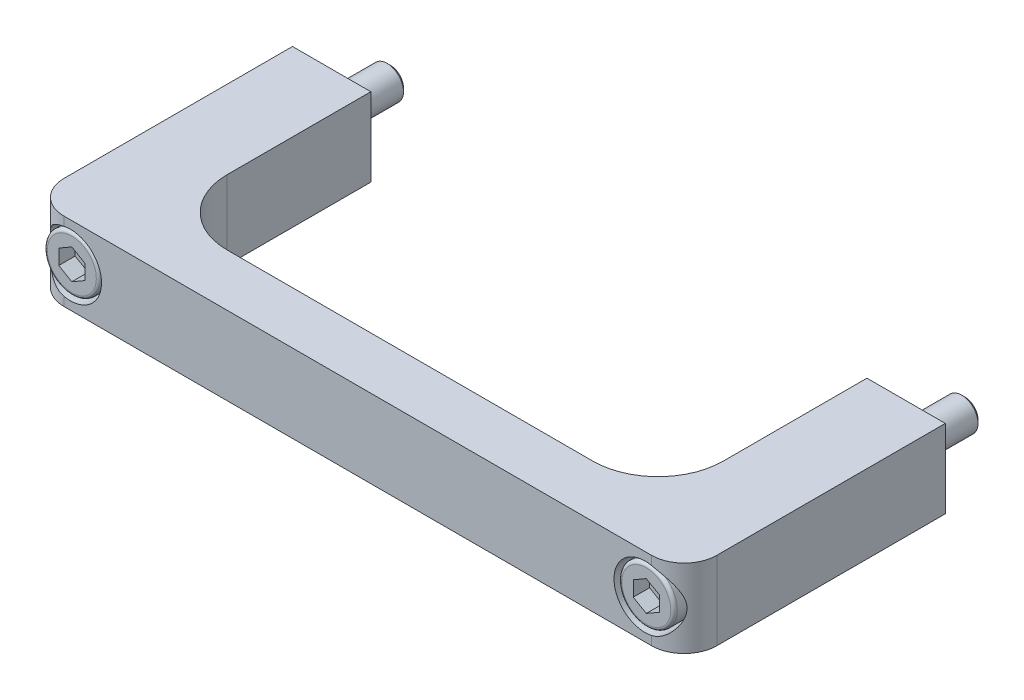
ISO-10303-21;
HEADER;
FILE_DESCRIPTION(('STEP AP214'),'2;1');
FILE_NAME('part.step','',(''),(''),'','','');
FILE_SCHEMA(('AUTOMOTIVE_DESIGN { 1 0 10303 214 1 1 1 1 }'));
ENDSEC;
DATA;
#1=APPLICATION_CONTEXT('core data for automotive mechanical design processes');
#2=APPLICATION_PROTOCOL_DEFINITION('international standard','automotive_design',2000,#1);
#3=PRODUCT_CONTEXT('',#1,'mechanical');
#4=PRODUCT('Part','Part','',(#3));
#5=PRODUCT_RELATED_PRODUCT_CATEGORY('part','',(#4));
#6=PRODUCT_DEFINITION_FORMATION('','',#4);
#7=PRODUCT_DEFINITION_CONTEXT('part definition',#1,'design');
#8=PRODUCT_DEFINITION('design','',#6,#7);
#9=PRODUCT_DEFINITION_SHAPE('','',#8);
#10=(LENGTH_UNIT() NAMED_UNIT(*) SI_UNIT(.MILLI.,.METRE.));
#11=(NAMED_UNIT(*) PLANE_ANGLE_UNIT() SI_UNIT($,.RADIAN.));
#12=(NAMED_UNIT(*) SI_UNIT($,.STERADIAN.) SOLID_ANGLE_UNIT());
#13=UNCERTAINTY_MEASURE_WITH_UNIT(LENGTH_MEASURE(1.E-05),#10,'distance_accuracy_value','');
#14=(GEOMETRIC_REPRESENTATION_CONTEXT(3) GLOBAL_UNCERTAINTY_ASSIGNED_CONTEXT((#13)) GLOBAL_UNIT_ASSIGNED_CONTEXT((#10,
#11,#12)) REPRESENTATION_CONTEXT('',''));
#15=CARTESIAN_POINT('',(0.,0.,0.));
#16=DIRECTION('',(0.,0.,1.));
#17=DIRECTION('',(1.,0.,0.));
#18=AXIS2_PLACEMENT_3D('',#15,#16,#17);
#19=CARTESIAN_POINT('',(0.,-1.30232253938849E-13,37.3));
#20=DIRECTION('',(0.,0.,1.));
#21=DIRECTION('',(0.,-1.,0.));
#22=AXIS2_PLACEMENT_3D('',#19,#20,#21);
#23=PLANE('',#22);
#24=DIRECTION('',(0.,-1.,0.));
#25=VECTOR('',#24,1.);
#26=CARTESIAN_POINT('',(86.,1.15470053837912,37.3));
#27=LINE('',#26,#25);
#28=CARTESIAN_POINT('',(86.,1.15470053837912,37.3));
#29=VERTEX_POINT('',#28);
#30=CARTESIAN_POINT('',(86.,-1.15470053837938,37.3));
#31=VERTEX_POINT('',#30);
#32=EDGE_CURVE('E192',#29,#31,#27,.T.);
#33=ORIENTED_EDGE('',*,*,#32,.T.);
#34=DIRECTION('',(0.866025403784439,-0.5,0.));
#35=VECTOR('',#34,1.);
#36=CARTESIAN_POINT('',(86.,-1.15470053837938,37.3));
#37=LINE('',#36,#35);
#38=CARTESIAN_POINT('',(88.,-2.30940107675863,37.3));
#39=VERTEX_POINT('',#38);
#40=EDGE_CURVE('E200',#31,#39,#37,.T.);
#41=ORIENTED_EDGE('',*,*,#40,.T.);
#42=DIRECTION('',(0.866025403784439,0.5,0.));
#43=VECTOR('',#42,1.);
#44=CARTESIAN_POINT('',(88.,-2.30940107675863,37.3));
#45=LINE('',#44,#43);
#46=CARTESIAN_POINT('',(90.,-1.15470053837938,37.3));
#47=VERTEX_POINT('',#46);
#48=EDGE_CURVE('E206',#39,#47,#45,.T.);
#49=ORIENTED_EDGE('',*,*,#48,.T.);
#50=DIRECTION('',(0.,1.,0.));
#51=VECTOR('',#50,1.);
#52=CARTESIAN_POINT('',(90.,-1.15470053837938,37.3));
#53=LINE('',#52,#51);
#54=CARTESIAN_POINT('',(90.,1.15470053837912,37.3));
#55=VERTEX_POINT('',#54);
#56=EDGE_CURVE('E219',#47,#55,#53,.T.);
#57=ORIENTED_EDGE('',*,*,#56,.T.);
#58=DIRECTION('',(-0.866025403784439,0.5,0.));
#59=VECTOR('',#58,1.);
#60=CARTESIAN_POINT('',(90.,1.15470053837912,37.3));
#61=LINE('',#60,#59);
#62=CARTESIAN_POINT('',(88.,2.30940107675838,37.3));
#63=VERTEX_POINT('',#62);
#64=EDGE_CURVE('E222',#55,#63,#61,.T.);
#65=ORIENTED_EDGE('',*,*,#64,.T.);
#66=DIRECTION('',(-0.866025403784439,-0.5,0.));
#67=VECTOR('',#66,1.);
#68=CARTESIAN_POINT('',(88.,2.30940107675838,37.3));
#69=LINE('',#68,#67);
#70=EDGE_CURVE('E210',#63,#29,#69,.T.);
#71=ORIENTED_EDGE('',*,*,#70,.T.);
#72=EDGE_LOOP('',(#33,#41,#49,#57,#65,#71));
#73=FACE_BOUND('',#72,.T.);
#74=ADVANCED_FACE('F14',(#73),#23,.T.);
#75=CARTESIAN_POINT('',(0.,-1.30232253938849E-13,37.3));
#76=DIRECTION('',(0.,0.,1.));
#77=DIRECTION('',(0.,-1.,0.));
#78=AXIS2_PLACEMENT_3D('',#75,#76,#77);
#79=PLANE('',#78);
#80=DIRECTION('',(0.,-1.,0.));
#81=VECTOR('',#80,1.);
#82=CARTESIAN_POINT('',(-2.,1.15470053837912,37.3));
#83=LINE('',#82,#81);
#84=CARTESIAN_POINT('',(-2.,1.15470053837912,37.3));
#85=VERTEX_POINT('',#84);
#86=CARTESIAN_POINT('',(-2.,-1.15470053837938,37.3));
#87=VERTEX_POINT('',#86);
#88=EDGE_CURVE('E196',#85,#87,#83,.T.);
#89=ORIENTED_EDGE('',*,*,#88,.T.);
#90=DIRECTION('',(0.866025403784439,-0.5,0.));
#91=VECTOR('',#90,1.);
#92=CARTESIAN_POINT('',(-2.,-1.15470053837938,37.3));
#93=LINE('',#92,#91);
#94=CARTESIAN_POINT('',(0.,-2.30940107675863,37.3));
#95=VERTEX_POINT('',#94);
#96=EDGE_CURVE('E235',#87,#95,#93,.T.);
#97=ORIENTED_EDGE('',*,*,#96,.T.);
#98=DIRECTION('',(0.866025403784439,0.5,0.));
#99=VECTOR('',#98,1.);
#100=CARTESIAN_POINT('',(0.,-2.30940107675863,37.3));
#101=LINE('',#100,#99);
#102=CARTESIAN_POINT('',(2.,-1.15470053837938,37.3));
#103=VERTEX_POINT('',#102);
#104=EDGE_CURVE('E238',#95,#103,#101,.T.);
#105=ORIENTED_EDGE('',*,*,#104,.T.);
#106=DIRECTION('',(0.,1.,0.));
#107=VECTOR('',#106,1.);
#108=CARTESIAN_POINT('',(2.,-1.15470053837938,37.3));
#109=LINE('',#108,#107);
#110=CARTESIAN_POINT('',(2.,1.15470053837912,37.3));
#111=VERTEX_POINT('',#110);
#112=EDGE_CURVE('E241',#103,#111,#109,.T.);
#113=ORIENTED_EDGE('',*,*,#112,.T.);
#114=DIRECTION('',(-0.866025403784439,0.5,0.));
#115=VECTOR('',#114,1.);
#116=CARTESIAN_POINT('',(2.,1.15470053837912,37.3));
#117=LINE('',#116,#115);
#118=CARTESIAN_POINT('',(0.,2.30940107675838,37.3));
#119=VERTEX_POINT('',#118);
#120=EDGE_CURVE('E244',#111,#119,#117,.T.);
#121=ORIENTED_EDGE('',*,*,#120,.T.);
#122=DIRECTION('',(-0.866025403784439,-0.5,0.));
#123=VECTOR('',#122,1.);
#124=CARTESIAN_POINT('',(0.,2.30940107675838,37.3));
#125=LINE('',#124,#123);
#126=EDGE_CURVE('E247',#119,#85,#125,.T.);
#127=ORIENTED_EDGE('',*,*,#126,.T.);
#128=EDGE_LOOP('',(#89,#97,#105,#113,#121,#127));
#129=FACE_BOUND('',#128,.T.);
#130=ADVANCED_FACE('F535',(#129),#79,.T.);
#131=CARTESIAN_POINT('',(86.,-1.1547005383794,42.3));
#132=DIRECTION('',(0.5,0.866025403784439,0.));
#133=DIRECTION('',(-0.866025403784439,0.5,0.));
#134=AXIS2_PLACEMENT_3D('',#131,#132,#133);
#135=PLANE('',#134);
#136=DIRECTION('',(0.866025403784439,-0.5,0.));
#137=VECTOR('',#136,1.);
#138=CARTESIAN_POINT('',(87.,-1.73205080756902,39.8));
#139=LINE('',#138,#137);
#140=CARTESIAN_POINT('',(86.,-1.15470053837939,39.8));
#141=VERTEX_POINT('',#140);
#142=CARTESIAN_POINT('',(88.,-2.30940107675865,39.8));
#143=VERTEX_POINT('',#142);
#144=EDGE_CURVE('E23',#141,#143,#139,.T.);
#145=ORIENTED_EDGE('',*,*,#144,.T.);
#146=DIRECTION('',(0.,0.,-1.));
#147=VECTOR('',#146,1.);
#148=CARTESIAN_POINT('',(88.,-2.30940107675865,42.3));
#149=LINE('',#148,#147);
#150=EDGE_CURVE('E197',#143,#39,#149,.T.);
#151=ORIENTED_EDGE('',*,*,#150,.T.);
#152=ORIENTED_EDGE('',*,*,#40,.F.);
#153=DIRECTION('',(0.,0.,-1.));
#154=VECTOR('',#153,1.);
#155=CARTESIAN_POINT('',(86.,-1.1547005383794,42.3));
#156=LINE('',#155,#154);
#157=EDGE_CURVE('E187',#141,#31,#156,.T.);
#158=ORIENTED_EDGE('',*,*,#157,.F.);
#159=EDGE_LOOP('',(#145,#151,#152,#158));
#160=FACE_BOUND('',#159,.T.);
#161=ADVANCED_FACE('F201',(#160),#135,.T.);
#162=CARTESIAN_POINT('',(88.,-2.30940107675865,42.3));
#163=DIRECTION('',(-0.5,0.866025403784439,0.));
#164=DIRECTION('',(-0.866025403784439,-0.5,0.));
#165=AXIS2_PLACEMENT_3D('',#162,#163,#164);
#166=PLANE('',#165);
#167=DIRECTION('',(0.866025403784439,0.5,0.));
#168=VECTOR('',#167,1.);
#169=CARTESIAN_POINT('',(89.,-1.73205080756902,39.8));
#170=LINE('',#169,#168);
#171=CARTESIAN_POINT('',(90.,-1.15470053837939,39.8));
#172=VERTEX_POINT('',#171);
#173=EDGE_CURVE('E438',#143,#172,#170,.T.);
#174=ORIENTED_EDGE('',*,*,#173,.T.);
#175=DIRECTION('',(0.,0.,-1.));
#176=VECTOR('',#175,1.);
#177=CARTESIAN_POINT('',(90.,-1.1547005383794,42.3));
#178=LINE('',#177,#176);
#179=EDGE_CURVE('E230',#172,#47,#178,.T.);
#180=ORIENTED_EDGE('',*,*,#179,.T.);
#181=ORIENTED_EDGE('',*,*,#48,.F.);
#182=ORIENTED_EDGE('',*,*,#150,.F.);
#183=EDGE_LOOP('',(#174,#180,#181,#182));
#184=FACE_BOUND('',#183,.T.);
#185=ADVANCED_FACE('F443',(#184),#166,.T.);
#186=CARTESIAN_POINT('',(90.,-1.1547005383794,42.3));
#187=DIRECTION('',(-1.,0.,0.));
#188=DIRECTION('',(0.,-1.,0.));
#189=AXIS2_PLACEMENT_3D('',#186,#187,#188);
#190=PLANE('',#189);
#191=ORIENTED_EDGE('',*,*,#179,.F.);
#192=DIRECTION('',(0.,1.,0.));
#193=VECTOR('',#192,1.);
#194=CARTESIAN_POINT('',(90.,-1.38960957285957E-13,39.8));
#195=LINE('',#194,#193);
#196=CARTESIAN_POINT('',(90.,1.15470053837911,39.8));
#197=VERTEX_POINT('',#196);
#198=EDGE_CURVE('E436',#172,#197,#195,.T.);
#199=ORIENTED_EDGE('',*,*,#198,.T.);
#200=DIRECTION('',(0.,0.,-1.));
#201=VECTOR('',#200,1.);
#202=CARTESIAN_POINT('',(90.,1.1547005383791,42.3));
#203=LINE('',#202,#201);
#204=EDGE_CURVE('E228',#197,#55,#203,.T.);
#205=ORIENTED_EDGE('',*,*,#204,.T.);
#206=ORIENTED_EDGE('',*,*,#56,.F.);
#207=EDGE_LOOP('',(#191,#199,#205,#206));
#208=FACE_BOUND('',#207,.T.);
#209=ADVANCED_FACE('F450',(#208),#190,.T.);
#210=CARTESIAN_POINT('',(90.,1.1547005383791,42.3));
#211=DIRECTION('',(-0.5,-0.866025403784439,0.));
#212=DIRECTION('',(0.866025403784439,-0.5,0.));
#213=AXIS2_PLACEMENT_3D('',#210,#211,#212);
#214=PLANE('',#213);
#215=DIRECTION('',(-0.866025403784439,0.5,0.));
#216=VECTOR('',#215,1.);
#217=CARTESIAN_POINT('',(89.,1.73205080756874,39.8));
#218=LINE('',#217,#216);
#219=CARTESIAN_POINT('',(88.,2.30940107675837,39.8));
#220=VERTEX_POINT('',#219);
#221=EDGE_CURVE('E434',#197,#220,#218,.T.);
#222=ORIENTED_EDGE('',*,*,#221,.T.);
#223=DIRECTION('',(0.,0.,-1.));
#224=VECTOR('',#223,1.);
#225=CARTESIAN_POINT('',(88.,2.30940107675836,42.3));
#226=LINE('',#225,#224);
#227=EDGE_CURVE('E30',#220,#63,#226,.T.);
#228=ORIENTED_EDGE('',*,*,#227,.T.);
#229=ORIENTED_EDGE('',*,*,#64,.F.);
#230=ORIENTED_EDGE('',*,*,#204,.F.);
#231=EDGE_LOOP('',(#222,#228,#229,#230));
#232=FACE_BOUND('',#231,.T.);
#233=ADVANCED_FACE('F454',(#232),#214,.T.);
#234=CARTESIAN_POINT('',(88.,2.30940107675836,42.3));
#235=DIRECTION('',(0.5,-0.866025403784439,0.));
#236=DIRECTION('',(0.866025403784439,0.5,0.));
#237=AXIS2_PLACEMENT_3D('',#234,#235,#236);
#238=PLANE('',#237);
#239=DIRECTION('',(-0.866025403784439,-0.5,0.));
#240=VECTOR('',#239,1.);
#241=CARTESIAN_POINT('',(87.,1.73205080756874,39.8));
#242=LINE('',#241,#240);
#243=CARTESIAN_POINT('',(86.,1.15470053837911,39.8));
#244=VERTEX_POINT('',#243);
#245=EDGE_CURVE('E432',#220,#244,#242,.T.);
#246=ORIENTED_EDGE('',*,*,#245,.T.);
#247=DIRECTION('',(0.,0.,-1.));
#248=VECTOR('',#247,1.);
#249=CARTESIAN_POINT('',(86.,1.1547005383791,42.3));
#250=LINE('',#249,#248);
#251=EDGE_CURVE('E225',#244,#29,#250,.T.);
#252=ORIENTED_EDGE('',*,*,#251,.T.);
#253=ORIENTED_EDGE('',*,*,#70,.F.);
#254=ORIENTED_EDGE('',*,*,#227,.F.);
#255=EDGE_LOOP('',(#246,#252,#253,#254));
#256=FACE_BOUND('',#255,.T.);
#257=ADVANCED_FACE('F455',(#256),#238,.T.);
#258=CARTESIAN_POINT('',(86.,1.1547005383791,42.3));
#259=DIRECTION('',(1.,0.,0.));
#260=DIRECTION('',(0.,1.,0.));
#261=AXIS2_PLACEMENT_3D('',#258,#259,#260);
#262=PLANE('',#261);
#263=DIRECTION('',(0.,-1.,0.));
#264=VECTOR('',#263,1.);
#265=CARTESIAN_POINT('',(86.,-1.38960957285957E-13,39.8));
#266=LINE('',#265,#264);
#267=EDGE_CURVE('E9',#244,#141,#266,.T.);
#268=ORIENTED_EDGE('',*,*,#267,.T.);
#269=ORIENTED_EDGE('',*,*,#157,.T.);
#270=ORIENTED_EDGE('',*,*,#32,.F.);
#271=ORIENTED_EDGE('',*,*,#251,.F.);
#272=EDGE_LOOP('',(#268,#269,#270,#271));
#273=FACE_BOUND('',#272,.T.);
#274=ADVANCED_FACE('F189',(#273),#262,.T.);
#275=CARTESIAN_POINT('',(-2.,-1.1547005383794,42.3));
#276=DIRECTION('',(0.5,0.866025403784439,0.));
#277=DIRECTION('',(-0.866025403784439,0.5,0.));
#278=AXIS2_PLACEMENT_3D('',#275,#276,#277);
#279=PLANE('',#278);
#280=DIRECTION('',(0.866025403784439,-0.5,0.));
#281=VECTOR('',#280,1.);
#282=CARTESIAN_POINT('',(-1.,-1.73205080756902,39.8));
#283=LINE('',#282,#281);
#284=CARTESIAN_POINT('',(-2.,-1.15470053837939,39.8));
#285=VERTEX_POINT('',#284);
#286=CARTESIAN_POINT('',(0.,-2.30940107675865,39.8));
#287=VERTEX_POINT('',#286);
#288=EDGE_CURVE('E428',#285,#287,#283,.T.);
#289=ORIENTED_EDGE('',*,*,#288,.T.);
#290=DIRECTION('',(0.,0.,-1.));
#291=VECTOR('',#290,1.);
#292=CARTESIAN_POINT('',(0.,-2.30940107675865,42.3));
#293=LINE('',#292,#291);
#294=EDGE_CURVE('E257',#287,#95,#293,.T.);
#295=ORIENTED_EDGE('',*,*,#294,.T.);
#296=ORIENTED_EDGE('',*,*,#96,.F.);
#297=DIRECTION('',(0.,0.,-1.));
#298=VECTOR('',#297,1.);
#299=CARTESIAN_POINT('',(-2.,-1.1547005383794,42.3));
#300=LINE('',#299,#298);
#301=EDGE_CURVE('E259',#285,#87,#300,.T.);
#302=ORIENTED_EDGE('',*,*,#301,.F.);
#303=EDGE_LOOP('',(#289,#295,#296,#302));
#304=FACE_BOUND('',#303,.T.);
#305=ADVANCED_FACE('F464',(#304),#279,.T.);
#306=CARTESIAN_POINT('',(0.,-2.30940107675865,42.3));
#307=DIRECTION('',(-0.5,0.866025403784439,0.));
#308=DIRECTION('',(-0.866025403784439,-0.5,0.));
#309=AXIS2_PLACEMENT_3D('',#306,#307,#308);
#310=PLANE('',#309);
#311=DIRECTION('',(0.866025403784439,0.5,0.));
#312=VECTOR('',#311,1.);
#313=CARTESIAN_POINT('',(1.,-1.73205080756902,39.8));
#314=LINE('',#313,#312);
#315=CARTESIAN_POINT('',(2.,-1.15470053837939,39.8));
#316=VERTEX_POINT('',#315);
#317=EDGE_CURVE('E425',#287,#316,#314,.T.);
#318=ORIENTED_EDGE('',*,*,#317,.T.);
#319=DIRECTION('',(0.,0.,-1.));
#320=VECTOR('',#319,1.);
#321=CARTESIAN_POINT('',(2.,-1.1547005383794,42.3));
#322=LINE('',#321,#320);
#323=EDGE_CURVE('E255',#316,#103,#322,.T.);
#324=ORIENTED_EDGE('',*,*,#323,.T.);
#325=ORIENTED_EDGE('',*,*,#104,.F.);
#326=ORIENTED_EDGE('',*,*,#294,.F.);
#327=EDGE_LOOP('',(#318,#324,#325,#326));
#328=FACE_BOUND('',#327,.T.);
#329=ADVANCED_FACE('F553',(#328),#310,.T.);
#330=CARTESIAN_POINT('',(2.,-1.1547005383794,42.3));
#331=DIRECTION('',(-1.,0.,0.));
#332=DIRECTION('',(0.,-1.,0.));
#333=AXIS2_PLACEMENT_3D('',#330,#331,#332);
#334=PLANE('',#333);
#335=ORIENTED_EDGE('',*,*,#323,.F.);
#336=DIRECTION('',(0.,1.,0.));
#337=VECTOR('',#336,1.);
#338=CARTESIAN_POINT('',(2.,-1.38960957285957E-13,39.8));
#339=LINE('',#338,#337);
#340=CARTESIAN_POINT('',(2.,1.15470053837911,39.8));
#341=VERTEX_POINT('',#340);
#342=EDGE_CURVE('E423',#316,#341,#339,.T.);
#343=ORIENTED_EDGE('',*,*,#342,.T.);
#344=DIRECTION('',(0.,0.,-1.));
#345=VECTOR('',#344,1.);
#346=CARTESIAN_POINT('',(2.,1.1547005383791,42.3));
#347=LINE('',#346,#345);
#348=EDGE_CURVE('E253',#341,#111,#347,.T.);
#349=ORIENTED_EDGE('',*,*,#348,.T.);
#350=ORIENTED_EDGE('',*,*,#112,.F.);
#351=EDGE_LOOP('',(#335,#343,#349,#350));
#352=FACE_BOUND('',#351,.T.);
#353=ADVANCED_FACE('F546',(#352),#334,.T.);
#354=CARTESIAN_POINT('',(2.,1.1547005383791,42.3));
#355=DIRECTION('',(-0.5,-0.866025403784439,0.));
#356=DIRECTION('',(0.866025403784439,-0.5,0.));
#357=AXIS2_PLACEMENT_3D('',#354,#355,#356);
#358=PLANE('',#357);
#359=DIRECTION('',(-0.866025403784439,0.5,0.));
#360=VECTOR('',#359,1.);
#361=CARTESIAN_POINT('',(1.,1.73205080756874,39.8));
#362=LINE('',#361,#360);
#363=CARTESIAN_POINT('',(0.,2.30940107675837,39.8));
#364=VERTEX_POINT('',#363);
#365=EDGE_CURVE('E421',#341,#364,#362,.T.);
#366=ORIENTED_EDGE('',*,*,#365,.T.);
#367=DIRECTION('',(0.,0.,-1.));
#368=VECTOR('',#367,1.);
#369=CARTESIAN_POINT('',(0.,2.30940107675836,42.3));
#370=LINE('',#369,#368);
#371=EDGE_CURVE('E38',#364,#119,#370,.T.);
#372=ORIENTED_EDGE('',*,*,#371,.T.);
#373=ORIENTED_EDGE('',*,*,#120,.F.);
#374=ORIENTED_EDGE('',*,*,#348,.F.);
#375=EDGE_LOOP('',(#366,#372,#373,#374));
#376=FACE_BOUND('',#375,.T.);
#377=ADVANCED_FACE('F539',(#376),#358,.T.);
#378=CARTESIAN_POINT('',(0.,2.30940107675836,42.3));
#379=DIRECTION('',(0.5,-0.866025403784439,0.));
#380=DIRECTION('',(0.866025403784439,0.5,0.));
#381=AXIS2_PLACEMENT_3D('',#378,#379,#380);
#382=PLANE('',#381);
#383=DIRECTION('',(-0.866025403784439,-0.5,0.));
#384=VECTOR('',#383,1.);
#385=CARTESIAN_POINT('',(-1.,1.73205080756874,39.8));
#386=LINE('',#385,#384);
#387=CARTESIAN_POINT('',(-2.,1.15470053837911,39.8));
#388=VERTEX_POINT('',#387);
#389=EDGE_CURVE('E419',#364,#388,#386,.T.);
#390=ORIENTED_EDGE('',*,*,#389,.T.);
#391=DIRECTION('',(0.,0.,-1.));
#392=VECTOR('',#391,1.);
#393=CARTESIAN_POINT('',(-2.,1.1547005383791,42.3));
#394=LINE('',#393,#392);
#395=EDGE_CURVE('E250',#388,#85,#394,.T.);
#396=ORIENTED_EDGE('',*,*,#395,.T.);
#397=ORIENTED_EDGE('',*,*,#126,.F.);
#398=ORIENTED_EDGE('',*,*,#371,.F.);
#399=EDGE_LOOP('',(#390,#396,#397,#398));
#400=FACE_BOUND('',#399,.T.);
#401=ADVANCED_FACE('F537',(#400),#382,.T.);
#402=CARTESIAN_POINT('',(-2.,1.1547005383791,42.3));
#403=DIRECTION('',(1.,0.,0.));
#404=DIRECTION('',(0.,1.,0.));
#405=AXIS2_PLACEMENT_3D('',#402,#403,#404);
#406=PLANE('',#405);
#407=DIRECTION('',(0.,-1.,0.));
#408=VECTOR('',#407,1.);
#409=CARTESIAN_POINT('',(-2.,-1.38960957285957E-13,39.8));
#410=LINE('',#409,#408);
#411=EDGE_CURVE('E430',#388,#285,#410,.T.);
#412=ORIENTED_EDGE('',*,*,#411,.T.);
#413=ORIENTED_EDGE('',*,*,#301,.T.);
#414=ORIENTED_EDGE('',*,*,#88,.F.);
#415=ORIENTED_EDGE('',*,*,#395,.F.);
#416=EDGE_LOOP('',(#412,#413,#414,#415));
#417=FACE_BOUND('',#416,.T.);
#418=ADVANCED_FACE('F489',(#417),#406,.T.);
#419=CARTESIAN_POINT('',(88.,-1.38960957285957E-13,39.8));
#420=DIRECTION('',(0.,0.,-1.));
#421=DIRECTION('',(0.,1.,0.));
#422=AXIS2_PLACEMENT_3D('',#419,#420,#421);
#423=PLANE('',#422);
#424=CARTESIAN_POINT('',(88.,-1.38960957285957E-13,39.8));
#425=DIRECTION('',(0.,0.,-1.));
#426=DIRECTION('',(0.,1.,0.));
#427=AXIS2_PLACEMENT_3D('',#424,#425,#426);
#428=CIRCLE('',#427,3.75);
#429=CARTESIAN_POINT('',(88.,3.74999999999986,39.8));
#430=VERTEX_POINT('',#429);
#431=EDGE_CURVE('E267',#430,#430,#428,.T.);
#432=ORIENTED_EDGE('',*,*,#431,.F.);
#433=EDGE_LOOP('',(#432));
#434=FACE_BOUND('',#433,.T.);
#435=ORIENTED_EDGE('',*,*,#267,.F.);
#436=ORIENTED_EDGE('',*,*,#245,.F.);
#437=ORIENTED_EDGE('',*,*,#221,.F.);
#438=ORIENTED_EDGE('',*,*,#198,.F.);
#439=ORIENTED_EDGE('',*,*,#173,.F.);
#440=ORIENTED_EDGE('',*,*,#144,.F.);
#441=EDGE_LOOP('',(#435,#436,#437,#438,#439,#440));
#442=FACE_BOUND('',#441,.T.);
#443=ADVANCED_FACE('F445',(#434,#442),#423,.F.);
#444=CARTESIAN_POINT('',(0.,-1.38960957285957E-13,39.8));
#445=DIRECTION('',(0.,0.,-1.));
#446=DIRECTION('',(0.,1.,0.));
#447=AXIS2_PLACEMENT_3D('',#444,#445,#446);
#448=PLANE('',#447);
#449=CARTESIAN_POINT('',(0.,-1.38960957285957E-13,39.8));
#450=DIRECTION('',(0.,0.,-1.));
#451=DIRECTION('',(0.,1.,0.));
#452=AXIS2_PLACEMENT_3D('',#449,#450,#451);
#453=CIRCLE('',#452,3.75);
#454=CARTESIAN_POINT('',(0.,3.74999999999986,39.8));
#455=VERTEX_POINT('',#454);
#456=EDGE_CURVE('E276',#455,#455,#453,.T.);
#457=ORIENTED_EDGE('',*,*,#456,.F.);
#458=EDGE_LOOP('',(#457));
#459=FACE_BOUND('',#458,.T.);
#460=ORIENTED_EDGE('',*,*,#411,.F.);
#461=ORIENTED_EDGE('',*,*,#389,.F.);
#462=ORIENTED_EDGE('',*,*,#365,.F.);
#463=ORIENTED_EDGE('',*,*,#342,.F.);
#464=ORIENTED_EDGE('',*,*,#317,.F.);
#465=ORIENTED_EDGE('',*,*,#288,.F.);
#466=EDGE_LOOP('',(#460,#461,#462,#463,#464,#465));
#467=FACE_BOUND('',#466,.T.);
#468=ADVANCED_FACE('F500',(#459,#467),#448,.F.);
#469=CARTESIAN_POINT('',(88.,-1.37215216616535E-13,39.3));
#470=DIRECTION('',(0.,0.,-1.));
#471=DIRECTION('',(0.,1.,0.));
#472=AXIS2_PLACEMENT_3D('',#469,#470,#471);
#473=TOROIDAL_SURFACE('',#472,3.75000000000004,0.499999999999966);
#474=ORIENTED_EDGE('',*,*,#431,.T.);
#475=EDGE_LOOP('',(#474));
#476=FACE_BOUND('',#475,.T.);
#477=CARTESIAN_POINT('',(88.,-1.37215216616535E-13,39.3));
#478=DIRECTION('',(0.,0.,-1.));
#479=DIRECTION('',(0.,1.,0.));
#480=AXIS2_PLACEMENT_3D('',#477,#478,#479);
#481=CIRCLE('',#480,4.25);
#482=CARTESIAN_POINT('',(88.,4.24999999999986,39.3));
#483=VERTEX_POINT('',#482);
#484=EDGE_CURVE('E264',#483,#483,#481,.T.);
#485=ORIENTED_EDGE('',*,*,#484,.F.);
#486=EDGE_LOOP('',(#485));
#487=FACE_BOUND('',#486,.T.);
#488=ADVANCED_FACE('F497',(#476,#487),#473,.T.);
#489=CARTESIAN_POINT('',(0.,-1.37215216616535E-13,39.3));
#490=DIRECTION('',(0.,0.,-1.));
#491=DIRECTION('',(0.,1.,0.));
#492=AXIS2_PLACEMENT_3D('',#489,#490,#491);
#493=TOROIDAL_SURFACE('',#492,3.75,0.5);
#494=ORIENTED_EDGE('',*,*,#456,.T.);
#495=EDGE_LOOP('',(#494));
#496=FACE_BOUND('',#495,.T.);
#497=CARTESIAN_POINT('',(0.,-1.37215216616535E-13,39.3));
#498=DIRECTION('',(0.,0.,-1.));
#499=DIRECTION('',(0.,1.,0.));
#500=AXIS2_PLACEMENT_3D('',#497,#498,#499);
#501=CIRCLE('',#500,4.25);
#502=CARTESIAN_POINT('',(0.,4.24999999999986,39.3));
#503=VERTEX_POINT('',#502);
#504=EDGE_CURVE('E273',#503,#503,#501,.T.);
#505=ORIENTED_EDGE('',*,*,#504,.F.);
#506=EDGE_LOOP('',(#505));
#507=FACE_BOUND('',#506,.T.);
#508=ADVANCED_FACE('F495',(#496,#507),#493,.T.);
#509=CARTESIAN_POINT('',(88.,0.,-9.));
#510=DIRECTION('',(0.,0.,-1.));
#511=DIRECTION('',(0.,1.,0.));
#512=AXIS2_PLACEMENT_3D('',#509,#510,#511);
#513=CYLINDRICAL_SURFACE('',#512,4.25);
#514=CARTESIAN_POINT('',(88.,-1.21503550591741E-13,34.8));
#515=DIRECTION('',(0.,0.,-1.));
#516=DIRECTION('',(0.,1.,0.));
#517=AXIS2_PLACEMENT_3D('',#514,#515,#516);
#518=CIRCLE('',#517,4.25);
#519=CARTESIAN_POINT('',(88.,4.24999999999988,34.8));
#520=VERTEX_POINT('',#519);
#521=EDGE_CURVE('E261',#520,#520,#518,.T.);
#522=ORIENTED_EDGE('',*,*,#521,.F.);
#523=EDGE_LOOP('',(#522));
#524=FACE_BOUND('',#523,.T.);
#525=ORIENTED_EDGE('',*,*,#484,.T.);
#526=EDGE_LOOP('',(#525));
#527=FACE_BOUND('',#526,.T.);
#528=ADVANCED_FACE('F491',(#524,#527),#513,.T.);
#529=CARTESIAN_POINT('',(0.,0.,-9.));
#530=DIRECTION('',(0.,0.,-1.));
#531=DIRECTION('',(0.,1.,0.));
#532=AXIS2_PLACEMENT_3D('',#529,#530,#531);
#533=CYLINDRICAL_SURFACE('',#532,4.25);
#534=CARTESIAN_POINT('',(0.,-1.21503550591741E-13,34.8));
#535=DIRECTION('',(0.,0.,-1.));
#536=DIRECTION('',(0.,1.,0.));
#537=AXIS2_PLACEMENT_3D('',#534,#535,#536);
#538=CIRCLE('',#537,4.25);
#539=CARTESIAN_POINT('',(0.,4.24999999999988,34.8));
#540=VERTEX_POINT('',#539);
#541=EDGE_CURVE('E270',#540,#540,#538,.T.);
#542=ORIENTED_EDGE('',*,*,#541,.F.);
#543=EDGE_LOOP('',(#542));
#544=FACE_BOUND('',#543,.T.);
#545=ORIENTED_EDGE('',*,*,#504,.T.);
#546=EDGE_LOOP('',(#545));
#547=FACE_BOUND('',#546,.T.);
#548=ADVANCED_FACE('F494',(#544,#547),#533,.T.);
#549=CARTESIAN_POINT('',(92.75,-1.21503550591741E-13,34.8));
#550=DIRECTION('',(0.,0.,1.));
#551=DIRECTION('',(0.,-1.,0.));
#552=AXIS2_PLACEMENT_3D('',#549,#550,#551);
#553=PLANE('',#552);
#554=ORIENTED_EDGE('',*,*,#521,.T.);
#555=EDGE_LOOP('',(#554));
#556=FACE_BOUND('',#555,.T.);
#557=CARTESIAN_POINT('',(88.,-1.21503550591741E-13,34.8));
#558=DIRECTION('',(0.,0.,-1.));
#559=DIRECTION('',(0.,1.,0.));
#560=AXIS2_PLACEMENT_3D('',#557,#558,#559);
#561=CIRCLE('',#560,4.75);
#562=CARTESIAN_POINT('',(88.,4.74999999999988,34.8));
#563=VERTEX_POINT('',#562);
#564=EDGE_CURVE('E279',#563,#563,#561,.T.);
#565=ORIENTED_EDGE('',*,*,#564,.F.);
#566=EDGE_LOOP('',(#565));
#567=FACE_BOUND('',#566,.T.);
#568=ADVANCED_FACE('F304',(#556,#567),#553,.T.);
#569=CARTESIAN_POINT('',(4.75,-1.21503550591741E-13,34.8));
#570=DIRECTION('',(0.,0.,1.));
#571=DIRECTION('',(0.,-1.,0.));
#572=AXIS2_PLACEMENT_3D('',#569,#570,#571);
#573=PLANE('',#572);
#574=ORIENTED_EDGE('',*,*,#541,.T.);
#575=EDGE_LOOP('',(#574));
#576=FACE_BOUND('',#575,.T.);
#577=CARTESIAN_POINT('',(0.,-1.21503550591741E-13,34.8));
#578=DIRECTION('',(0.,0.,-1.));
#579=DIRECTION('',(0.,1.,0.));
#580=AXIS2_PLACEMENT_3D('',#577,#578,#579);
#581=CIRCLE('',#580,4.75);
#582=CARTESIAN_POINT('',(0.,4.74999999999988,34.8));
#583=VERTEX_POINT('',#582);
#584=EDGE_CURVE('E290',#583,#583,#581,.T.);
#585=ORIENTED_EDGE('',*,*,#584,.F.);
#586=EDGE_LOOP('',(#585));
#587=FACE_BOUND('',#586,.T.);
#588=ADVANCED_FACE('F302',(#576,#587),#573,.T.);
#589=CARTESIAN_POINT('',(88.,0.,0.));
#590=DIRECTION('',(0.,0.,-1.));
#591=DIRECTION('',(0.,1.,0.));
#592=AXIS2_PLACEMENT_3D('',#589,#590,#591);
#593=CYLINDRICAL_SURFACE('',#592,4.75);
#594=ORIENTED_EDGE('',*,*,#564,.T.);
#595=EDGE_LOOP('',(#594));
#596=FACE_BOUND('',#595,.T.);
#597=CARTESIAN_POINT('',(89.,-4.64354390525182,40.));
#598=CARTESIAN_POINT('',(89.113577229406,-4.61911352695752,40.000026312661));
#599=CARTESIAN_POINT('',(89.2261989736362,-4.5904727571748,39.996131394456));
#600=CARTESIAN_POINT('',(89.4484801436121,-4.5252330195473,39.9810830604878));
#601=CARTESIAN_POINT('',(89.5581428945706,-4.48864344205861,39.9699381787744));
#602=CARTESIAN_POINT('',(89.7727785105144,-4.40826406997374,39.9410985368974));
#603=CARTESIAN_POINT('',(89.8777841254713,-4.36454038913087,39.9234622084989));
#604=CARTESIAN_POINT('',(90.0834508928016,-4.2701927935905,39.8823298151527));
#605=CARTESIAN_POINT('',(90.1841109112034,-4.2195670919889,39.8588322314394));
#606=CARTESIAN_POINT('',(90.4778166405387,-4.05863601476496,39.7808868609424));
#607=CARTESIAN_POINT('',(90.6637550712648,-3.93883272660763,39.7188155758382));
#608=CARTESIAN_POINT('',(91.0141615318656,-3.67767986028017,39.5802666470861));
#609=CARTESIAN_POINT('',(91.1785767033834,-3.5362790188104,39.5037546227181));
#610=CARTESIAN_POINT('',(91.5055631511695,-3.21450833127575,39.3313669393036));
#611=CARTESIAN_POINT('',(91.6648440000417,-3.03145406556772,39.2342729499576));
#612=CARTESIAN_POINT('',(91.9535549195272,-2.64393120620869,39.0381869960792));
#613=CARTESIAN_POINT('',(92.0829676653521,-2.43945028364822,38.9391939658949));
#614=CARTESIAN_POINT('',(92.3004062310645,-2.02927596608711,38.7583847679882));
#615=CARTESIAN_POINT('',(92.3911023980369,-1.82533494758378,38.6758243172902));
#616=CARTESIAN_POINT('',(92.5442204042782,-1.40111936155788,38.528431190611));
#617=CARTESIAN_POINT('',(92.606705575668,-1.1808826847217,38.4635589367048));
#618=CARTESIAN_POINT('',(92.6893902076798,-0.77750572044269,38.3750946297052));
#619=CARTESIAN_POINT('',(92.7159053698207,-0.597016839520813,38.3455288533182));
#620=CARTESIAN_POINT('',(92.7478525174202,-0.232010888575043,38.3097185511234));
#621=CARTESIAN_POINT('',(92.7533170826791,-0.047500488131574,38.3034379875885));
#622=CARTESIAN_POINT('',(92.7427725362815,0.320047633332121,38.3153716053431));
#623=CARTESIAN_POINT('',(92.7267645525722,0.503085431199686,38.3335844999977));
#624=CARTESIAN_POINT('',(92.6745073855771,0.862962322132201,38.3910845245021));
#625=CARTESIAN_POINT('',(92.6382176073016,1.03978822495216,38.4304139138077));
#626=CARTESIAN_POINT('',(92.5280009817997,1.4574449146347,38.5442545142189));
#627=CARTESIAN_POINT('',(92.4446409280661,1.69363572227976,38.626612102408));
#628=CARTESIAN_POINT('',(92.295087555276,2.032247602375,38.7612447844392));
#629=CARTESIAN_POINT('',(92.2410521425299,2.14265838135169,38.8080496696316));
#630=CARTESIAN_POINT('',(92.1250506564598,2.35826640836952,38.9038071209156));
#631=CARTESIAN_POINT('',(92.0630855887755,2.46346431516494,38.9527594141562));
#632=CARTESIAN_POINT('',(91.8607080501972,2.77873907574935,39.1043117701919));
#633=CARTESIAN_POINT('',(91.7074779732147,2.98020199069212,39.2081022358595));
#634=CARTESIAN_POINT('',(91.3688464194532,3.35822314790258,39.4076351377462));
#635=CARTESIAN_POINT('',(91.1834791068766,3.53480748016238,39.5033859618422));
#636=CARTESIAN_POINT('',(90.8096663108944,3.83632408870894,39.6648073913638));
#637=CARTESIAN_POINT('',(90.6253318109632,3.96502834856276,39.7328152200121));
#638=CARTESIAN_POINT('',(90.3334066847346,4.13890556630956,39.8199942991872));
#639=CARTESIAN_POINT('',(90.2336119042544,4.19363274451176,39.8465668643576));
#640=CARTESIAN_POINT('',(90.0292831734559,4.29622741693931,39.8940340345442));
#641=CARTESIAN_POINT('',(89.9247508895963,4.34409729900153,39.9149306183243));
#642=CARTESIAN_POINT('',(89.6871516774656,4.44253129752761,39.9543331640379));
#643=CARTESIAN_POINT('',(89.5530154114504,4.49121867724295,39.9712061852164));
#644=CARTESIAN_POINT('',(89.3481874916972,4.5552211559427,39.9883353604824));
#645=CARTESIAN_POINT('',(89.2792063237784,4.57507245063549,39.9926820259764));
#646=CARTESIAN_POINT('',(89.1402725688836,4.6116637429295,39.9985159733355));
#647=CARTESIAN_POINT('',(89.0703195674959,4.62840236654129,40.0000019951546));
#648=CARTESIAN_POINT('',(89.,4.64354390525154,40.));
#649=B_SPLINE_CURVE_WITH_KNOTS('',3,(#597,#598,#599,#600,#601,#602,#603,#604,#605,#606,#607,
#608,#609,#610,#611,#612,#613,#614,#615,#616,#617,#618,#619,#620,#621,#622,#623,#624,#625,#626,
#627,#628,#629,#630,#631,#632,#633,#634,#635,#636,#637,#638,#639,#640,#641,#642,#643,#644,#645,
#646,#647,#648),.UNSPECIFIED.,.F.,.F.,(4,2,2,2,2,2,2,2,2,2,2,2,2,2,2,2,2,2,2,2,2,2,2,2,2,4),(0.,
0.348307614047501,0.696205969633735,1.04104644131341,1.38597636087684,2.07210353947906,
2.7598853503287,3.54118531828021,4.32293734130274,5.03460033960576,5.74465765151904,
6.29670085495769,6.84788932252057,7.3990488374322,7.95131549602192,8.73767249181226,
9.13202620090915,9.52632994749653,10.3438248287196,11.1604559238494,11.8620649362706,
12.2123213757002,12.5624555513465,12.992467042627,13.2080905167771,13.4238089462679),.UNSPECIFIED.);
#650=CARTESIAN_POINT('',(89.,-4.64354390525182,40.));
#651=VERTEX_POINT('',#650);
#652=CARTESIAN_POINT('',(89.,4.64354390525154,40.));
#653=VERTEX_POINT('',#652);
#654=EDGE_CURVE('E282',#651,#653,#649,.T.);
#655=ORIENTED_EDGE('',*,*,#654,.T.);
#656=CARTESIAN_POINT('',(88.,-1.39659253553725E-13,40.));
#657=DIRECTION('',(0.,0.,-1.));
#658=DIRECTION('',(0.,1.,0.));
#659=AXIS2_PLACEMENT_3D('',#656,#657,#658);
#660=CIRCLE('',#659,4.75);
#661=EDGE_CURVE('E417',#653,#651,#660,.F.);
#662=ORIENTED_EDGE('',*,*,#661,.T.);
#663=EDGE_LOOP('',(#655,#662));
#664=FACE_BOUND('',#663,.T.);
#665=ADVANCED_FACE('F296',(#596,#664),#593,.F.);
#666=CARTESIAN_POINT('',(0.,0.,0.));
#667=DIRECTION('',(0.,0.,-1.));
#668=DIRECTION('',(0.,1.,0.));
#669=AXIS2_PLACEMENT_3D('',#666,#667,#668);
#670=CYLINDRICAL_SURFACE('',#669,4.75);
#671=ORIENTED_EDGE('',*,*,#584,.T.);
#672=EDGE_LOOP('',(#671));
#673=FACE_BOUND('',#672,.T.);
#674=CARTESIAN_POINT('',(-0.999999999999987,4.64354390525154,40.));
#675=CARTESIAN_POINT('',(-1.11357722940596,4.61911352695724,40.000026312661));
#676=CARTESIAN_POINT('',(-1.22619897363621,4.59047275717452,39.9961313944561));
#677=CARTESIAN_POINT('',(-1.44848014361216,4.52523301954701,39.9810830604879));
#678=CARTESIAN_POINT('',(-1.55814289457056,4.48864344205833,39.9699381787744));
#679=CARTESIAN_POINT('',(-1.7727785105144,4.40826406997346,39.9410985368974));
#680=CARTESIAN_POINT('',(-1.87778412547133,4.3645403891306,39.9234622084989));
#681=CARTESIAN_POINT('',(-2.08345089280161,4.27019279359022,39.8823298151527));
#682=CARTESIAN_POINT('',(-2.18411091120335,4.21956709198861,39.8588322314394));
#683=CARTESIAN_POINT('',(-2.47781664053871,4.05863601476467,39.7808868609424));
#684=CARTESIAN_POINT('',(-2.66375507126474,3.93883272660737,39.7188155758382));
#685=CARTESIAN_POINT('',(-3.0141615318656,3.67767986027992,39.5802666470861));
#686=CARTESIAN_POINT('',(-3.17857670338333,3.53627901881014,39.5037546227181));
#687=CARTESIAN_POINT('',(-3.50556315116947,3.21450833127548,39.3313669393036));
#688=CARTESIAN_POINT('',(-3.66484400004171,3.03145406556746,39.2342729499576));
#689=CARTESIAN_POINT('',(-3.95355491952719,2.64393120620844,39.0381869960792));
#690=CARTESIAN_POINT('',(-4.0829676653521,2.43945028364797,38.9391939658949));
#691=CARTESIAN_POINT('',(-4.30040623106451,2.02927596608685,38.7583847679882));
#692=CARTESIAN_POINT('',(-4.39110239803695,1.82533494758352,38.6758243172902));
#693=CARTESIAN_POINT('',(-4.54422040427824,1.40111936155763,38.528431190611));
#694=CARTESIAN_POINT('',(-4.606705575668,1.18088268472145,38.4635589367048));
#695=CARTESIAN_POINT('',(-4.68939020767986,0.777505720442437,38.3750946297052));
#696=CARTESIAN_POINT('',(-4.71590536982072,0.597016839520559,38.3455288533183));
#697=CARTESIAN_POINT('',(-4.74785251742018,0.23201088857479,38.3097185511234));
#698=CARTESIAN_POINT('',(-4.75331708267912,0.0475004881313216,38.3034379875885));
#699=CARTESIAN_POINT('',(-4.74277253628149,-0.320047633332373,38.3153716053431));
#700=CARTESIAN_POINT('',(-4.72676455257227,-0.503085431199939,38.3335844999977));
#701=CARTESIAN_POINT('',(-4.67450738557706,-0.862962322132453,38.3910845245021));
#702=CARTESIAN_POINT('',(-4.63821760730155,-1.03978822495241,38.4304139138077));
#703=CARTESIAN_POINT('',(-4.52800098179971,-1.45744491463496,38.5442545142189));
#704=CARTESIAN_POINT('',(-4.44464092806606,-1.69363572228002,38.626612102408));
#705=CARTESIAN_POINT('',(-4.29508755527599,-2.03224760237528,38.7612447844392));
#706=CARTESIAN_POINT('',(-4.24105214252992,-2.14265838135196,38.8080496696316));
#707=CARTESIAN_POINT('',(-4.1250506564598,-2.35826640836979,38.9038071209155));
#708=CARTESIAN_POINT('',(-4.06308558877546,-2.4634643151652,38.9527594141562));
#709=CARTESIAN_POINT('',(-3.86070805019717,-2.7787390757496,39.1043117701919));
#710=CARTESIAN_POINT('',(-3.70747797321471,-2.98020199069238,39.2081022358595));
#711=CARTESIAN_POINT('',(-3.36884641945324,-3.35822314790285,39.4076351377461));
#712=CARTESIAN_POINT('',(-3.18347910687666,-3.53480748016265,39.5033859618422));
#713=CARTESIAN_POINT('',(-2.80966631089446,-3.83632408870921,39.6648073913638));
#714=CARTESIAN_POINT('',(-2.62533181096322,-3.96502834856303,39.7328152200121));
#715=CARTESIAN_POINT('',(-2.33340668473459,-4.13890556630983,39.8199942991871));
#716=CARTESIAN_POINT('',(-2.23361190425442,-4.19363274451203,39.8465668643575));
#717=CARTESIAN_POINT('',(-2.0292831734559,-4.29622741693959,39.8940340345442));
#718=CARTESIAN_POINT('',(-1.92475088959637,-4.34409729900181,39.9149306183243));
#719=CARTESIAN_POINT('',(-1.68715167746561,-4.44253129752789,39.9543331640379));
#720=CARTESIAN_POINT('',(-1.55301541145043,-4.49121867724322,39.9712061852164));
#721=CARTESIAN_POINT('',(-1.34818749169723,-4.55522115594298,39.9883353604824));
#722=CARTESIAN_POINT('',(-1.27920632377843,-4.57507245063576,39.9926820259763));
#723=CARTESIAN_POINT('',(-1.14027256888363,-4.61166374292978,39.9985159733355));
#724=CARTESIAN_POINT('',(-1.07031956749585,-4.62840236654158,40.0000019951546));
#725=CARTESIAN_POINT('',(-0.999999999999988,-4.64354390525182,40.));
#726=B_SPLINE_CURVE_WITH_KNOTS('',3,(#674,#675,#676,#677,#678,#679,#680,#681,#682,#683,#684,
#685,#686,#687,#688,#689,#690,#691,#692,#693,#694,#695,#696,#697,#698,#699,#700,#701,#702,#703,
#704,#705,#706,#707,#708,#709,#710,#711,#712,#713,#714,#715,#716,#717,#718,#719,#720,#721,#722,
#723,#724,#725),.UNSPECIFIED.,.F.,.F.,(4,2,2,2,2,2,2,2,2,2,2,2,2,2,2,2,2,2,2,2,2,2,2,2,2,4),(0.,
0.348307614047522,0.696205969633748,1.04104644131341,1.38597636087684,2.07210353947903,
2.75988535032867,3.54118531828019,4.32293734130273,5.03460033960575,5.74465765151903,
6.29670085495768,6.84788932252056,7.39904883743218,7.95131549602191,8.73767249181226,
9.13202620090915,9.52632994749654,10.3438248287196,11.1604559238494,11.8620649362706,
12.2123213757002,12.5624555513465,12.992467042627,13.2080905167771,13.4238089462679),.UNSPECIFIED.);
#727=CARTESIAN_POINT('',(-0.999999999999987,4.64354390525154,40.));
#728=VERTEX_POINT('',#727);
#729=CARTESIAN_POINT('',(-0.999999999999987,-4.64354390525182,40.));
#730=VERTEX_POINT('',#729);
#731=EDGE_CURVE('E316',#728,#730,#726,.T.);
#732=ORIENTED_EDGE('',*,*,#731,.T.);
#733=CARTESIAN_POINT('',(0.,-1.39659253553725E-13,40.));
#734=DIRECTION('',(0.,0.,-1.));
#735=DIRECTION('',(0.,1.,0.));
#736=AXIS2_PLACEMENT_3D('',#733,#734,#735);
#737=CIRCLE('',#736,4.75);
#738=EDGE_CURVE('E415',#730,#728,#737,.F.);
#739=ORIENTED_EDGE('',*,*,#738,.T.);
#740=EDGE_LOOP('',(#732,#739));
#741=FACE_BOUND('',#740,.T.);
#742=ADVANCED_FACE('F301',(#673,#741),#670,.F.);
#743=CARTESIAN_POINT('',(16.,-6.00000000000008,22.));
#744=DIRECTION('',(0.,1.,0.));
#745=DIRECTION('',(-1.,0.,0.));
#746=AXIS2_PLACEMENT_3D('',#743,#744,#745);
#747=CYLINDRICAL_SURFACE('',#746,10.);
#748=CARTESIAN_POINT('',(16.,5.99999999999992,22.));
#749=DIRECTION('',(0.,-1.,0.));
#750=DIRECTION('',(1.,0.,0.));
#751=AXIS2_PLACEMENT_3D('',#748,#749,#750);
#752=CIRCLE('',#751,10.);
#753=CARTESIAN_POINT('',(16.,5.99999999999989,32.));
#754=VERTEX_POINT('',#753);
#755=CARTESIAN_POINT('',(6.,5.99999999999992,22.));
#756=VERTEX_POINT('',#755);
#757=EDGE_CURVE('E362',#754,#756,#752,.T.);
#758=ORIENTED_EDGE('',*,*,#757,.F.);
#759=DIRECTION('',(0.,1.,0.));
#760=VECTOR('',#759,1.);
#761=CARTESIAN_POINT('',(16.,-6.00000000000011,32.));
#762=LINE('',#761,#760);
#763=CARTESIAN_POINT('',(16.,-6.00000000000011,32.));
#764=VERTEX_POINT('',#763);
#765=EDGE_CURVE('E402',#764,#754,#762,.T.);
#766=ORIENTED_EDGE('',*,*,#765,.F.);
#767=CARTESIAN_POINT('',(16.,-6.00000000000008,22.));
#768=DIRECTION('',(0.,-1.,0.));
#769=DIRECTION('',(1.,0.,0.));
#770=AXIS2_PLACEMENT_3D('',#767,#768,#769);
#771=CIRCLE('',#770,10.);
#772=CARTESIAN_POINT('',(6.,-6.00000000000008,22.));
#773=VERTEX_POINT('',#772);
#774=EDGE_CURVE('E334',#764,#773,#771,.T.);
#775=ORIENTED_EDGE('',*,*,#774,.T.);
#776=DIRECTION('',(0.,1.,0.));
#777=VECTOR('',#776,1.);
#778=CARTESIAN_POINT('',(6.,-6.00000000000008,22.));
#779=LINE('',#778,#777);
#780=EDGE_CURVE('E404',#773,#756,#779,.T.);
#781=ORIENTED_EDGE('',*,*,#780,.T.);
#782=EDGE_LOOP('',(#758,#766,#775,#781));
#783=FACE_BOUND('',#782,.T.);
#784=ADVANCED_FACE('F312',(#783),#747,.F.);
#785=CARTESIAN_POINT('',(16.,-6.00000000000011,32.));
#786=DIRECTION('',(0.,0.,1.));
#787=DIRECTION('',(0.,-1.,0.));
#788=AXIS2_PLACEMENT_3D('',#785,#786,#787);
#789=PLANE('',#788);
#790=DIRECTION('',(1.,0.,0.));
#791=VECTOR('',#790,1.);
#792=CARTESIAN_POINT('',(16.,5.99999999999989,32.));
#793=LINE('',#792,#791);
#794=CARTESIAN_POINT('',(72.,5.99999999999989,32.));
#795=VERTEX_POINT('',#794);
#796=EDGE_CURVE('E365',#754,#795,#793,.T.);
#797=ORIENTED_EDGE('',*,*,#796,.T.);
#798=DIRECTION('',(0.,1.,0.));
#799=VECTOR('',#798,1.);
#800=CARTESIAN_POINT('',(72.,-6.00000000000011,32.));
#801=LINE('',#800,#799);
#802=CARTESIAN_POINT('',(72.,-6.00000000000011,32.));
#803=VERTEX_POINT('',#802);
#804=EDGE_CURVE('E400',#803,#795,#801,.T.);
#805=ORIENTED_EDGE('',*,*,#804,.F.);
#806=DIRECTION('',(1.,0.,0.));
#807=VECTOR('',#806,1.);
#808=CARTESIAN_POINT('',(16.,-6.00000000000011,32.));
#809=LINE('',#808,#807);
#810=EDGE_CURVE('E337',#764,#803,#809,.T.);
#811=ORIENTED_EDGE('',*,*,#810,.F.);
#812=ORIENTED_EDGE('',*,*,#765,.T.);
#813=EDGE_LOOP('',(#797,#805,#811,#812));
#814=FACE_BOUND('',#813,.T.);
#815=ADVANCED_FACE('F742',(#814),#789,.F.);
#816=CARTESIAN_POINT('',(72.,-6.00000000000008,22.));
#817=DIRECTION('',(0.,1.,0.));
#818=DIRECTION('',(-1.,0.,0.));
#819=AXIS2_PLACEMENT_3D('',#816,#817,#818);
#820=CYLINDRICAL_SURFACE('',#819,10.);
#821=CARTESIAN_POINT('',(72.,5.99999999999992,22.));
#822=DIRECTION('',(0.,-1.,0.));
#823=DIRECTION('',(1.,0.,0.));
#824=AXIS2_PLACEMENT_3D('',#821,#822,#823);
#825=CIRCLE('',#824,10.);
#826=CARTESIAN_POINT('',(82.,5.99999999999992,22.));
#827=VERTEX_POINT('',#826);
#828=EDGE_CURVE('E368',#827,#795,#825,.T.);
#829=ORIENTED_EDGE('',*,*,#828,.F.);
#830=DIRECTION('',(0.,1.,0.));
#831=VECTOR('',#830,1.);
#832=CARTESIAN_POINT('',(82.,-6.00000000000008,22.));
#833=LINE('',#832,#831);
#834=CARTESIAN_POINT('',(82.,-6.00000000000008,22.));
#835=VERTEX_POINT('',#834);
#836=EDGE_CURVE('E398',#835,#827,#833,.T.);
#837=ORIENTED_EDGE('',*,*,#836,.F.);
#838=CARTESIAN_POINT('',(72.,-6.00000000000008,22.));
#839=DIRECTION('',(0.,-1.,0.));
#840=DIRECTION('',(1.,0.,0.));
#841=AXIS2_PLACEMENT_3D('',#838,#839,#840);
#842=CIRCLE('',#841,10.);
#843=EDGE_CURVE('E339',#835,#803,#842,.T.);
#844=ORIENTED_EDGE('',*,*,#843,.T.);
#845=ORIENTED_EDGE('',*,*,#804,.T.);
#846=EDGE_LOOP('',(#829,#837,#844,#845));
#847=FACE_BOUND('',#846,.T.);
#848=ADVANCED_FACE('F708',(#847),#820,.F.);
#849=CARTESIAN_POINT('',(89.,-6.00000000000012,35.));
#850=DIRECTION('',(0.,1.,0.));
#851=DIRECTION('',(-1.,0.,0.));
#852=AXIS2_PLACEMENT_3D('',#849,#850,#851);
#853=CYLINDRICAL_SURFACE('',#852,5.);
#854=ORIENTED_EDGE('',*,*,#654,.F.);
#855=DIRECTION('',(0.,1.,0.));
#856=VECTOR('',#855,1.);
#857=CARTESIAN_POINT('',(89.,-6.00000000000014,40.));
#858=LINE('',#857,#856);
#859=CARTESIAN_POINT('',(89.,-6.00000000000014,40.));
#860=VERTEX_POINT('',#859);
#861=EDGE_CURVE('E386',#860,#651,#858,.T.);
#862=ORIENTED_EDGE('',*,*,#861,.F.);
#863=CARTESIAN_POINT('',(89.,-6.00000000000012,35.));
#864=DIRECTION('',(0.,-1.,0.));
#865=DIRECTION('',(1.,0.,0.));
#866=AXIS2_PLACEMENT_3D('',#863,#864,#865);
#867=CIRCLE('',#866,5.);
#868=CARTESIAN_POINT('',(94.,-6.00000000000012,35.));
#869=VERTEX_POINT('',#868);
#870=EDGE_CURVE('E348',#869,#860,#867,.T.);
#871=ORIENTED_EDGE('',*,*,#870,.F.);
#872=DIRECTION('',(0.,1.,0.));
#873=VECTOR('',#872,1.);
#874=CARTESIAN_POINT('',(94.,-6.00000000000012,35.));
#875=LINE('',#874,#873);
#876=CARTESIAN_POINT('',(94.,5.99999999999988,35.));
#877=VERTEX_POINT('',#876);
#878=EDGE_CURVE('E389',#869,#877,#875,.T.);
#879=ORIENTED_EDGE('',*,*,#878,.T.);
#880=CARTESIAN_POINT('',(89.,5.99999999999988,35.));
#881=DIRECTION('',(0.,-1.,0.));
#882=DIRECTION('',(1.,0.,0.));
#883=AXIS2_PLACEMENT_3D('',#880,#881,#882);
#884=CIRCLE('',#883,5.);
#885=CARTESIAN_POINT('',(89.,5.99999999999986,40.));
#886=VERTEX_POINT('',#885);
#887=EDGE_CURVE('E377',#877,#886,#884,.T.);
#888=ORIENTED_EDGE('',*,*,#887,.T.);
#889=EDGE_CURVE('E385',#653,#886,#858,.T.);
#890=ORIENTED_EDGE('',*,*,#889,.F.);
#891=EDGE_LOOP('',(#854,#862,#871,#879,#888,#890));
#892=FACE_BOUND('',#891,.T.);
#893=ADVANCED_FACE('F292',(#892),#853,.T.);
#894=CARTESIAN_POINT('',(89.,-6.00000000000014,40.));
#895=DIRECTION('',(0.,0.,-1.));
#896=DIRECTION('',(0.,1.,0.));
#897=AXIS2_PLACEMENT_3D('',#894,#895,#896);
#898=PLANE('',#897);
#899=ORIENTED_EDGE('',*,*,#661,.F.);
#900=ORIENTED_EDGE('',*,*,#889,.T.);
#901=DIRECTION('',(-1.,0.,0.));
#902=VECTOR('',#901,1.);
#903=CARTESIAN_POINT('',(89.,5.99999999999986,40.));
#904=LINE('',#903,#902);
#905=CARTESIAN_POINT('',(-0.999999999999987,5.99999999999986,40.));
#906=VERTEX_POINT('',#905);
#907=EDGE_CURVE('E328',#886,#906,#904,.T.);
#908=ORIENTED_EDGE('',*,*,#907,.T.);
#909=DIRECTION('',(0.,1.,0.));
#910=VECTOR('',#909,1.);
#911=CARTESIAN_POINT('',(-0.999999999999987,-6.00000000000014,40.));
#912=LINE('',#911,#910);
#913=EDGE_CURVE('E352',#728,#906,#912,.T.);
#914=ORIENTED_EDGE('',*,*,#913,.F.);
#915=ORIENTED_EDGE('',*,*,#738,.F.);
#916=CARTESIAN_POINT('',(-0.999999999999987,-6.00000000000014,40.));
#917=VERTEX_POINT('',#916);
#918=EDGE_CURVE('E382',#917,#730,#912,.T.);
#919=ORIENTED_EDGE('',*,*,#918,.F.);
#920=DIRECTION('',(-1.,0.,0.));
#921=VECTOR('',#920,1.);
#922=CARTESIAN_POINT('',(89.,-6.00000000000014,40.));
#923=LINE('',#922,#921);
#924=EDGE_CURVE('E350',#860,#917,#923,.T.);
#925=ORIENTED_EDGE('',*,*,#924,.F.);
#926=ORIENTED_EDGE('',*,*,#861,.T.);
#927=EDGE_LOOP('',(#899,#900,#908,#914,#915,#919,#925,#926));
#928=FACE_BOUND('',#927,.T.);
#929=ADVANCED_FACE('F707',(#928),#898,.F.);
#930=CARTESIAN_POINT('',(-1.,-6.00000000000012,35.));
#931=DIRECTION('',(0.,1.,0.));
#932=DIRECTION('',(-1.,0.,0.));
#933=AXIS2_PLACEMENT_3D('',#930,#931,#932);
#934=CYLINDRICAL_SURFACE('',#933,5.);
#935=ORIENTED_EDGE('',*,*,#731,.F.);
#936=ORIENTED_EDGE('',*,*,#913,.T.);
#937=CARTESIAN_POINT('',(-1.,5.99999999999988,35.));
#938=DIRECTION('',(0.,-1.,0.));
#939=DIRECTION('',(1.,0.,0.));
#940=AXIS2_PLACEMENT_3D('',#937,#938,#939);
#941=CIRCLE('',#940,5.);
#942=CARTESIAN_POINT('',(-6.,5.99999999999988,35.));
#943=VERTEX_POINT('',#942);
#944=EDGE_CURVE('E323',#906,#943,#941,.T.);
#945=ORIENTED_EDGE('',*,*,#944,.T.);
#946=DIRECTION('',(0.,1.,0.));
#947=VECTOR('',#946,1.);
#948=CARTESIAN_POINT('',(-6.,-6.00000000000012,35.));
#949=LINE('',#948,#947);
#950=CARTESIAN_POINT('',(-6.,-6.00000000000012,35.));
#951=VERTEX_POINT('',#950);
#952=EDGE_CURVE('E412',#951,#943,#949,.T.);
#953=ORIENTED_EDGE('',*,*,#952,.F.);
#954=CARTESIAN_POINT('',(-1.,-6.00000000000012,35.));
#955=DIRECTION('',(0.,-1.,0.));
#956=DIRECTION('',(1.,0.,0.));
#957=AXIS2_PLACEMENT_3D('',#954,#955,#956);
#958=CIRCLE('',#957,5.);
#959=EDGE_CURVE('E324',#917,#951,#958,.T.);
#960=ORIENTED_EDGE('',*,*,#959,.F.);
#961=ORIENTED_EDGE('',*,*,#918,.T.);
#962=EDGE_LOOP('',(#935,#936,#945,#953,#960,#961));
#963=FACE_BOUND('',#962,.T.);
#964=ADVANCED_FACE('F16',(#963),#934,.T.);
#965=CARTESIAN_POINT('',(82.,-6.00000000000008,22.));
#966=DIRECTION('',(1.,0.,0.));
#967=DIRECTION('',(0.,1.,0.));
#968=AXIS2_PLACEMENT_3D('',#965,#966,#967);
#969=PLANE('',#968);
#970=DIRECTION('',(0.,0.,-1.));
#971=VECTOR('',#970,1.);
#972=CARTESIAN_POINT('',(82.,5.99999999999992,22.));
#973=LINE('',#972,#971);
#974=CARTESIAN_POINT('',(82.,6.,0.));
#975=VERTEX_POINT('',#974);
#976=EDGE_CURVE('E371',#827,#975,#973,.T.);
#977=ORIENTED_EDGE('',*,*,#976,.T.);
#978=DIRECTION('',(0.,1.,0.));
#979=VECTOR('',#978,1.);
#980=CARTESIAN_POINT('',(82.,-6.,0.));
#981=LINE('',#980,#979);
#982=CARTESIAN_POINT('',(82.,-6.,0.));
#983=VERTEX_POINT('',#982);
#984=EDGE_CURVE('E395',#983,#975,#981,.T.);
#985=ORIENTED_EDGE('',*,*,#984,.F.);
#986=DIRECTION('',(0.,0.,-1.));
#987=VECTOR('',#986,1.);
#988=CARTESIAN_POINT('',(82.,-6.00000000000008,22.));
#989=LINE('',#988,#987);
#990=EDGE_CURVE('E342',#835,#983,#989,.T.);
#991=ORIENTED_EDGE('',*,*,#990,.F.);
#992=ORIENTED_EDGE('',*,*,#836,.T.);
#993=EDGE_LOOP('',(#977,#985,#991,#992));
#994=FACE_BOUND('',#993,.T.);
#995=ADVANCED_FACE('F722',(#994),#969,.F.);
#996=CARTESIAN_POINT('',(94.,-6.,0.));
#997=DIRECTION('',(-1.,0.,0.));
#998=DIRECTION('',(0.,-1.,0.));
#999=AXIS2_PLACEMENT_3D('',#996,#997,#998);
#1000=PLANE('',#999);
#1001=DIRECTION('',(0.,0.,1.));
#1002=VECTOR('',#1001,1.);
#1003=CARTESIAN_POINT('',(94.,6.,0.));
#1004=LINE('',#1003,#1002);
#1005=CARTESIAN_POINT('',(94.,6.,0.));
#1006=VERTEX_POINT('',#1005);
#1007=EDGE_CURVE('E375',#1006,#877,#1004,.T.);
#1008=ORIENTED_EDGE('',*,*,#1007,.T.);
#1009=ORIENTED_EDGE('',*,*,#878,.F.);
#1010=DIRECTION('',(0.,0.,1.));
#1011=VECTOR('',#1010,1.);
#1012=CARTESIAN_POINT('',(94.,-6.,0.));
#1013=LINE('',#1012,#1011);
#1014=CARTESIAN_POINT('',(94.,-6.,0.));
#1015=VERTEX_POINT('',#1014);
#1016=EDGE_CURVE('E346',#1015,#869,#1013,.T.);
#1017=ORIENTED_EDGE('',*,*,#1016,.F.);
#1018=DIRECTION('',(0.,1.,0.));
#1019=VECTOR('',#1018,1.);
#1020=CARTESIAN_POINT('',(94.,-6.,0.));
#1021=LINE('',#1020,#1019);
#1022=EDGE_CURVE('E392',#1015,#1006,#1021,.T.);
#1023=ORIENTED_EDGE('',*,*,#1022,.T.);
#1024=EDGE_LOOP('',(#1008,#1009,#1017,#1023));
#1025=FACE_BOUND('',#1024,.T.);
#1026=ADVANCED_FACE('F716',(#1025),#1000,.F.);
#1027=CARTESIAN_POINT('',(-6.,-6.00000000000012,35.));
#1028=DIRECTION('',(1.,0.,0.));
#1029=DIRECTION('',(0.,1.,0.));
#1030=AXIS2_PLACEMENT_3D('',#1027,#1028,#1029);
#1031=PLANE('',#1030);
#1032=DIRECTION('',(0.,0.,-1.));
#1033=VECTOR('',#1032,1.);
#1034=CARTESIAN_POINT('',(-6.,5.99999999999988,35.));
#1035=LINE('',#1034,#1033);
#1036=CARTESIAN_POINT('',(-6.,6.,0.));
#1037=VERTEX_POINT('',#1036);
#1038=EDGE_CURVE('E355',#943,#1037,#1035,.T.);
#1039=ORIENTED_EDGE('',*,*,#1038,.T.);
#1040=DIRECTION('',(0.,1.,0.));
#1041=VECTOR('',#1040,1.);
#1042=CARTESIAN_POINT('',(-6.,-6.,0.));
#1043=LINE('',#1042,#1041);
#1044=CARTESIAN_POINT('',(-6.,-6.,0.));
#1045=VERTEX_POINT('',#1044);
#1046=EDGE_CURVE('E409',#1045,#1037,#1043,.T.);
#1047=ORIENTED_EDGE('',*,*,#1046,.F.);
#1048=DIRECTION('',(0.,0.,-1.));
#1049=VECTOR('',#1048,1.);
#1050=CARTESIAN_POINT('',(-6.,-6.00000000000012,35.));
#1051=LINE('',#1050,#1049);
#1052=EDGE_CURVE('E327',#951,#1045,#1051,.T.);
#1053=ORIENTED_EDGE('',*,*,#1052,.F.);
#1054=ORIENTED_EDGE('',*,*,#952,.T.);
#1055=EDGE_LOOP('',(#1039,#1047,#1053,#1054));
#1056=FACE_BOUND('',#1055,.T.);
#1057=ADVANCED_FACE('F721',(#1056),#1031,.F.);
#1058=CARTESIAN_POINT('',(-1.,-6.00000000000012,35.));
#1059=DIRECTION('',(0.,-1.,0.));
#1060=DIRECTION('',(1.,0.,0.));
#1061=AXIS2_PLACEMENT_3D('',#1058,#1059,#1060);
#1062=PLANE('',#1061);
#1063=ORIENTED_EDGE('',*,*,#959,.T.);
#1064=ORIENTED_EDGE('',*,*,#1052,.T.);
#1065=DIRECTION('',(1.,0.,0.));
#1066=VECTOR('',#1065,1.);
#1067=CARTESIAN_POINT('',(-6.,-6.,0.));
#1068=LINE('',#1067,#1066);
#1069=CARTESIAN_POINT('',(6.,-6.,0.));
#1070=VERTEX_POINT('',#1069);
#1071=EDGE_CURVE('E330',#1045,#1070,#1068,.T.);
#1072=ORIENTED_EDGE('',*,*,#1071,.T.);
#1073=DIRECTION('',(0.,0.,1.));
#1074=VECTOR('',#1073,1.);
#1075=CARTESIAN_POINT('',(6.,-6.,0.));
#1076=LINE('',#1075,#1074);
#1077=EDGE_CURVE('E332',#1070,#773,#1076,.T.);
#1078=ORIENTED_EDGE('',*,*,#1077,.T.);
#1079=ORIENTED_EDGE('',*,*,#774,.F.);
#1080=ORIENTED_EDGE('',*,*,#810,.T.);
#1081=ORIENTED_EDGE('',*,*,#843,.F.);
#1082=ORIENTED_EDGE('',*,*,#990,.T.);
#1083=DIRECTION('',(1.,0.,0.));
#1084=VECTOR('',#1083,1.);
#1085=CARTESIAN_POINT('',(82.,-6.,0.));
#1086=LINE('',#1085,#1084);
#1087=EDGE_CURVE('E344',#983,#1015,#1086,.T.);
#1088=ORIENTED_EDGE('',*,*,#1087,.T.);
#1089=ORIENTED_EDGE('',*,*,#1016,.T.);
#1090=ORIENTED_EDGE('',*,*,#870,.T.);
#1091=ORIENTED_EDGE('',*,*,#924,.T.);
#1092=EDGE_LOOP('',(#1063,#1064,#1072,#1078,#1079,#1080,#1081,#1082,#1088,#1089,#1090,#1091));
#1093=FACE_BOUND('',#1092,.T.);
#1094=ADVANCED_FACE('F314',(#1093),#1062,.T.);
#1095=CARTESIAN_POINT('',(6.,-6.,0.));
#1096=DIRECTION('',(-1.,0.,0.));
#1097=DIRECTION('',(0.,-1.,0.));
#1098=AXIS2_PLACEMENT_3D('',#1095,#1096,#1097);
#1099=PLANE('',#1098);
#1100=DIRECTION('',(0.,0.,1.));
#1101=VECTOR('',#1100,1.);
#1102=CARTESIAN_POINT('',(6.,6.,0.));
#1103=LINE('',#1102,#1101);
#1104=CARTESIAN_POINT('',(6.,6.,0.));
#1105=VERTEX_POINT('',#1104);
#1106=EDGE_CURVE('E359',#1105,#756,#1103,.T.);
#1107=ORIENTED_EDGE('',*,*,#1106,.T.);
#1108=ORIENTED_EDGE('',*,*,#780,.F.);
#1109=ORIENTED_EDGE('',*,*,#1077,.F.);
#1110=DIRECTION('',(0.,1.,0.));
#1111=VECTOR('',#1110,1.);
#1112=CARTESIAN_POINT('',(6.,-6.,0.));
#1113=LINE('',#1112,#1111);
#1114=EDGE_CURVE('E406',#1070,#1105,#1113,.T.);
#1115=ORIENTED_EDGE('',*,*,#1114,.T.);
#1116=EDGE_LOOP('',(#1107,#1108,#1109,#1115));
#1117=FACE_BOUND('',#1116,.T.);
#1118=ADVANCED_FACE('F766',(#1117),#1099,.F.);
#1119=CARTESIAN_POINT('',(-1.,5.99999999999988,35.));
#1120=DIRECTION('',(0.,-1.,0.));
#1121=DIRECTION('',(1.,0.,0.));
#1122=AXIS2_PLACEMENT_3D('',#1119,#1120,#1121);
#1123=PLANE('',#1122);
#1124=ORIENTED_EDGE('',*,*,#944,.F.);
#1125=ORIENTED_EDGE('',*,*,#907,.F.);
#1126=ORIENTED_EDGE('',*,*,#887,.F.);
#1127=ORIENTED_EDGE('',*,*,#1007,.F.);
#1128=DIRECTION('',(1.,0.,0.));
#1129=VECTOR('',#1128,1.);
#1130=CARTESIAN_POINT('',(82.,6.,0.));
#1131=LINE('',#1130,#1129);
#1132=EDGE_CURVE('E373',#975,#1006,#1131,.T.);
#1133=ORIENTED_EDGE('',*,*,#1132,.F.);
#1134=ORIENTED_EDGE('',*,*,#976,.F.);
#1135=ORIENTED_EDGE('',*,*,#828,.T.);
#1136=ORIENTED_EDGE('',*,*,#796,.F.);
#1137=ORIENTED_EDGE('',*,*,#757,.T.);
#1138=ORIENTED_EDGE('',*,*,#1106,.F.);
#1139=DIRECTION('',(1.,0.,0.));
#1140=VECTOR('',#1139,1.);
#1141=CARTESIAN_POINT('',(-6.,6.,0.));
#1142=LINE('',#1141,#1140);
#1143=EDGE_CURVE('E357',#1037,#1105,#1142,.T.);
#1144=ORIENTED_EDGE('',*,*,#1143,.F.);
#1145=ORIENTED_EDGE('',*,*,#1038,.F.);
#1146=EDGE_LOOP('',(#1124,#1125,#1126,#1127,#1133,#1134,#1135,#1136,#1137,#1138,#1144,#1145));
#1147=FACE_BOUND('',#1146,.T.);
#1148=ADVANCED_FACE('F770',(#1147),#1123,.F.);
#1149=CARTESIAN_POINT('',(-6.,-6.,0.));
#1150=DIRECTION('',(0.,0.,1.));
#1151=DIRECTION('',(0.,-1.,0.));
#1152=AXIS2_PLACEMENT_3D('',#1149,#1150,#1151);
#1153=PLANE('',#1152);
#1154=ORIENTED_EDGE('',*,*,#1143,.T.);
#1155=ORIENTED_EDGE('',*,*,#1114,.F.);
#1156=ORIENTED_EDGE('',*,*,#1071,.F.);
#1157=ORIENTED_EDGE('',*,*,#1046,.T.);
#1158=EDGE_LOOP('',(#1154,#1155,#1156,#1157));
#1159=FACE_BOUND('',#1158,.T.);
#1160=CARTESIAN_POINT('',(0.,0.,0.));
#1161=DIRECTION('',(0.,0.,-1.));
#1162=DIRECTION('',(0.,1.,0.));
#1163=AXIS2_PLACEMENT_3D('',#1160,#1161,#1162);
#1164=CIRCLE('',#1163,2.5);
#1165=CARTESIAN_POINT('',(0.,2.5,0.));
#1166=VERTEX_POINT('',#1165);
#1167=EDGE_CURVE('E214',#1166,#1166,#1164,.T.);
#1168=ORIENTED_EDGE('',*,*,#1167,.F.);
#1169=EDGE_LOOP('',(#1168));
#1170=FACE_BOUND('',#1169,.T.);
#1171=ADVANCED_FACE('F507',(#1159,#1170),#1153,.F.);
#1172=CARTESIAN_POINT('',(0.,0.,-9.));
#1173=DIRECTION('',(0.,0.,-1.));
#1174=DIRECTION('',(0.,1.,0.));
#1175=AXIS2_PLACEMENT_3D('',#1172,#1173,#1174);
#1176=CYLINDRICAL_SURFACE('',#1175,2.5);
#1177=ORIENTED_EDGE('',*,*,#1167,.T.);
#1178=EDGE_LOOP('',(#1177));
#1179=FACE_BOUND('',#1178,.T.);
#1180=CARTESIAN_POINT('',(0.,0.,-8.5095));
#1181=DIRECTION('',(0.,0.,-1.));
#1182=DIRECTION('',(0.,1.,0.));
#1183=AXIS2_PLACEMENT_3D('',#1180,#1181,#1182);
#1184=CIRCLE('',#1183,2.5);
#1185=CARTESIAN_POINT('',(0.,2.50000000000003,-8.50949999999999));
#1186=VERTEX_POINT('',#1185);
#1187=EDGE_CURVE('E870',#1186,#1186,#1184,.T.);
#1188=ORIENTED_EDGE('',*,*,#1187,.F.);
#1189=EDGE_LOOP('',(#1188));
#1190=FACE_BOUND('',#1189,.T.);
#1191=ADVANCED_FACE('F483',(#1179,#1190),#1176,.T.);
#1192=CARTESIAN_POINT('',(82.,-6.,0.));
#1193=DIRECTION('',(0.,0.,1.));
#1194=DIRECTION('',(0.,-1.,0.));
#1195=AXIS2_PLACEMENT_3D('',#1192,#1193,#1194);
#1196=PLANE('',#1195);
#1197=ORIENTED_EDGE('',*,*,#1132,.T.);
#1198=ORIENTED_EDGE('',*,*,#1022,.F.);
#1199=ORIENTED_EDGE('',*,*,#1087,.F.);
#1200=ORIENTED_EDGE('',*,*,#984,.T.);
#1201=EDGE_LOOP('',(#1197,#1198,#1199,#1200));
#1202=FACE_BOUND('',#1201,.T.);
#1203=CARTESIAN_POINT('',(88.,0.,0.));
#1204=DIRECTION('',(0.,0.,-1.));
#1205=DIRECTION('',(0.,1.,0.));
#1206=AXIS2_PLACEMENT_3D('',#1203,#1204,#1205);
#1207=CIRCLE('',#1206,2.5);
#1208=CARTESIAN_POINT('',(88.,2.5,0.));
#1209=VERTEX_POINT('',#1208);
#1210=EDGE_CURVE('E211',#1209,#1209,#1207,.T.);
#1211=ORIENTED_EDGE('',*,*,#1210,.F.);
#1212=EDGE_LOOP('',(#1211));
#1213=FACE_BOUND('',#1212,.T.);
#1214=ADVANCED_FACE('F471',(#1202,#1213),#1196,.F.);
#1215=CARTESIAN_POINT('',(88.,0.,-9.));
#1216=DIRECTION('',(0.,0.,-1.));
#1217=DIRECTION('',(0.,1.,0.));
#1218=AXIS2_PLACEMENT_3D('',#1215,#1216,#1217);
#1219=CYLINDRICAL_SURFACE('',#1218,2.5);
#1220=ORIENTED_EDGE('',*,*,#1210,.T.);
#1221=EDGE_LOOP('',(#1220));
#1222=FACE_BOUND('',#1221,.T.);
#1223=CARTESIAN_POINT('',(88.,0.,-8.5095));
#1224=DIRECTION('',(0.,0.,-1.));
#1225=DIRECTION('',(0.,1.,0.));
#1226=AXIS2_PLACEMENT_3D('',#1223,#1224,#1225);
#1227=CIRCLE('',#1226,2.5);
#1228=CARTESIAN_POINT('',(88.,2.50000000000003,-8.50949999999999));
#1229=VERTEX_POINT('',#1228);
#1230=EDGE_CURVE('E868',#1229,#1229,#1227,.T.);
#1231=ORIENTED_EDGE('',*,*,#1230,.F.);
#1232=EDGE_LOOP('',(#1231));
#1233=FACE_BOUND('',#1232,.T.);
#1234=ADVANCED_FACE('F468',(#1222,#1233),#1219,.T.);
#1235=CARTESIAN_POINT('',(2.0095,0.,-9.));
#1236=DIRECTION('',(0.,0.,1.));
#1237=DIRECTION('',(0.,-1.,0.));
#1238=AXIS2_PLACEMENT_3D('',#1235,#1236,#1237);
#1239=PLANE('',#1238);
#1240=CARTESIAN_POINT('',(0.,0.,-9.));
#1241=DIRECTION('',(0.,0.,-1.));
#1242=DIRECTION('',(0.,1.,0.));
#1243=AXIS2_PLACEMENT_3D('',#1240,#1241,#1242);
#1244=CIRCLE('',#1243,2.0095);
#1245=CARTESIAN_POINT('',(0.,2.00950000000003,-8.99999999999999));
#1246=VERTEX_POINT('',#1245);
#1247=EDGE_CURVE('E875',#1246,#1246,#1244,.T.);
#1248=ORIENTED_EDGE('',*,*,#1247,.T.);
#1249=EDGE_LOOP('',(#1248));
#1250=FACE_BOUND('',#1249,.T.);
#1251=ADVANCED_FACE('F470',(#1250),#1239,.F.);
#1252=CARTESIAN_POINT('',(0.,0.,-8.5095));
#1253=DIRECTION('',(0.,0.,1.));
#1254=DIRECTION('',(0.,-1.,0.));
#1255=AXIS2_PLACEMENT_3D('',#1252,#1253,#1254);
#1256=CONICAL_SURFACE('',#1255,2.5,0.785398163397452);
#1257=ORIENTED_EDGE('',*,*,#1247,.F.);
#1258=EDGE_LOOP('',(#1257));
#1259=FACE_BOUND('',#1258,.T.);
#1260=ORIENTED_EDGE('',*,*,#1187,.T.);
#1261=EDGE_LOOP('',(#1260));
#1262=FACE_BOUND('',#1261,.T.);
#1263=ADVANCED_FACE('F479',(#1259,#1262),#1256,.T.);
#1264=CARTESIAN_POINT('',(90.0095,0.,-9.));
#1265=DIRECTION('',(0.,0.,1.));
#1266=DIRECTION('',(0.,-1.,0.));
#1267=AXIS2_PLACEMENT_3D('',#1264,#1265,#1266);
#1268=PLANE('',#1267);
#1269=CARTESIAN_POINT('',(88.,0.,-9.));
#1270=DIRECTION('',(0.,0.,-1.));
#1271=DIRECTION('',(0.,1.,0.));
#1272=AXIS2_PLACEMENT_3D('',#1269,#1270,#1271);
#1273=CIRCLE('',#1272,2.0095);
#1274=CARTESIAN_POINT('',(88.,2.00950000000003,-8.99999999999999));
#1275=VERTEX_POINT('',#1274);
#1276=EDGE_CURVE('E865',#1275,#1275,#1273,.T.);
#1277=ORIENTED_EDGE('',*,*,#1276,.T.);
#1278=EDGE_LOOP('',(#1277));
#1279=FACE_BOUND('',#1278,.T.);
#1280=ADVANCED_FACE('F848',(#1279),#1268,.F.);
#1281=CARTESIAN_POINT('',(88.,0.,-8.5095));
#1282=DIRECTION('',(0.,0.,1.));
#1283=DIRECTION('',(0.,-1.,0.));
#1284=AXIS2_PLACEMENT_3D('',#1281,#1282,#1283);
#1285=CONICAL_SURFACE('',#1284,2.5,0.785398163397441);
#1286=ORIENTED_EDGE('',*,*,#1276,.F.);
#1287=EDGE_LOOP('',(#1286));
#1288=FACE_BOUND('',#1287,.T.);
#1289=ORIENTED_EDGE('',*,*,#1230,.T.);
#1290=EDGE_LOOP('',(#1289));
#1291=FACE_BOUND('',#1290,.T.);
#1292=ADVANCED_FACE('F482',(#1288,#1291),#1285,.T.);
#1293=CLOSED_SHELL('',(#74,#130,#161,#185,#209,#233,#257,#274,#305,#329,#353,#377,#401,#418,
#443,#468,#488,#508,#528,#548,#568,#588,#665,#742,#784,#815,#848,#893,#929,#964,#995,#1026,
#1057,#1094,#1118,#1148,#1171,#1191,#1214,#1234,#1251,#1263,#1280,#1292));
#1294=MANIFOLD_SOLID_BREP('B1',#1293);
#1295=ADVANCED_BREP_SHAPE_REPRESENTATION('',(#18,#1294),#14);
#1296=SHAPE_DEFINITION_REPRESENTATION(#9,#1295);
ENDSEC;
END-ISO-10303-21;
